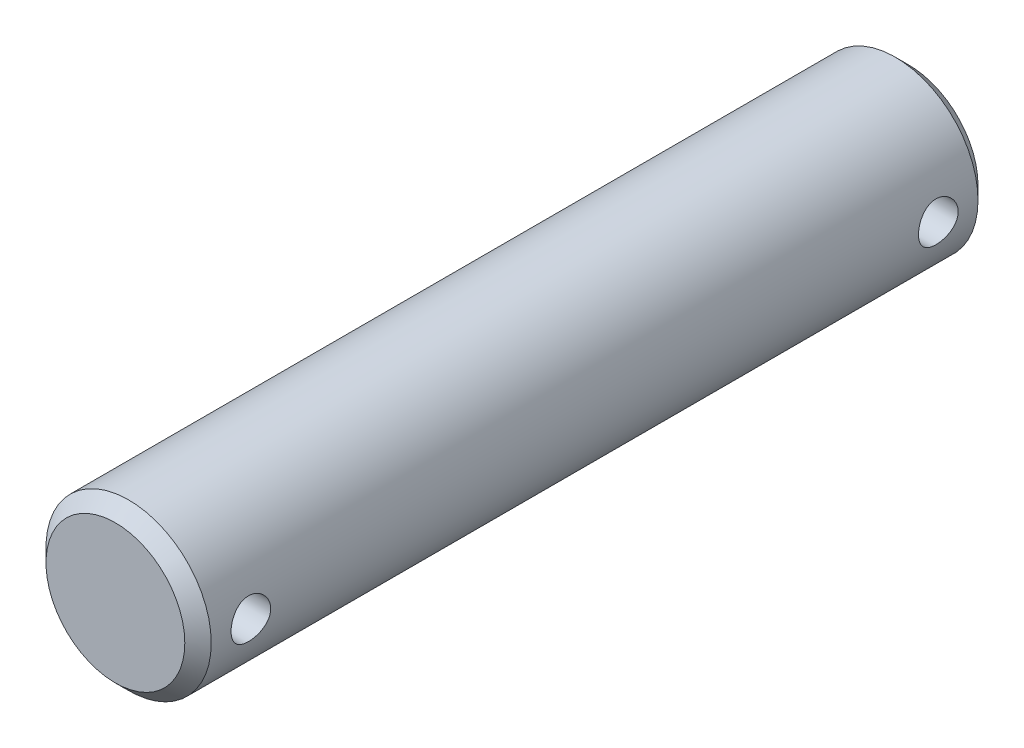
from build123d import *

# Parameters (mm, degrees)
ESQUISSE1_R             = 12.5
BASE_EXTRUSION_DEPTH    = 120
CHANFREIN1_SIZE         = 2
ESQUISSE2_R             = 3
ENL_V_MAT_EXTRU_1_DEPTH = 14


with BuildPart() as part:
    # Esquisse1 → Base-Extrusion (new body)
    with BuildSketch(Plane.XY):
        Circle(ESQUISSE1_R)
    extrude(amount=BASE_EXTRUSION_DEPTH)

    # Chanfrein1
    chanfrein1_edges = [part.edges().sort_by_distance(p)[0] for p in [
        (-12.5, 0, 0),
        (-12.5, 0, 120),
    ]]
    chamfer(chanfrein1_edges, length=CHANFREIN1_SIZE)

    # Esquisse2 → Enl_v. mat.-Extru.1 (cut, symmetric)
    with BuildSketch(Plane(origin=(0, 0, 0), x_dir=(0, 0, -1), z_dir=(1, 0, 0))):
        with Locations(Location((-8, 0, 0), (0, 0, 180))):
            Circle(ESQUISSE2_R)
        with Locations(Location((-112, 0, 0), (0, 0, 180))):
            Circle(ESQUISSE2_R)
    extrude(amount=ENL_V_MAT_EXTRU_1_DEPTH, both=True, mode=Mode.SUBTRACT)


solid = part.part
